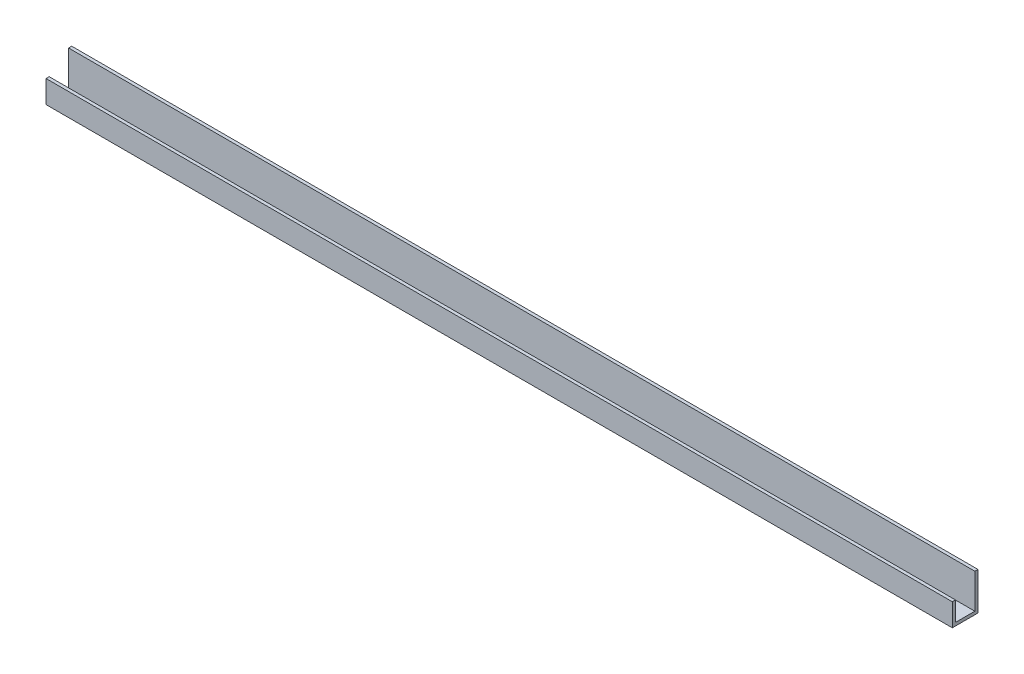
ISO-10303-21;
HEADER;
FILE_DESCRIPTION(('STEP AP214'),'2;1');
FILE_NAME('part.step','',(''),(''),'','','');
FILE_SCHEMA(('AUTOMOTIVE_DESIGN { 1 0 10303 214 1 1 1 1 }'));
ENDSEC;
DATA;
#1=APPLICATION_CONTEXT('core data for automotive mechanical design processes');
#2=APPLICATION_PROTOCOL_DEFINITION('international standard','automotive_design',2000,#1);
#3=PRODUCT_CONTEXT('',#1,'mechanical');
#4=PRODUCT('Part','Part','',(#3));
#5=PRODUCT_RELATED_PRODUCT_CATEGORY('part','',(#4));
#6=PRODUCT_DEFINITION_FORMATION('','',#4);
#7=PRODUCT_DEFINITION_CONTEXT('part definition',#1,'design');
#8=PRODUCT_DEFINITION('design','',#6,#7);
#9=PRODUCT_DEFINITION_SHAPE('','',#8);
#10=(LENGTH_UNIT() NAMED_UNIT(*) SI_UNIT(.MILLI.,.METRE.));
#11=(NAMED_UNIT(*) PLANE_ANGLE_UNIT() SI_UNIT($,.RADIAN.));
#12=(NAMED_UNIT(*) SI_UNIT($,.STERADIAN.) SOLID_ANGLE_UNIT());
#13=UNCERTAINTY_MEASURE_WITH_UNIT(LENGTH_MEASURE(1.E-05),#10,'distance_accuracy_value','');
#14=(GEOMETRIC_REPRESENTATION_CONTEXT(3) GLOBAL_UNCERTAINTY_ASSIGNED_CONTEXT((#13)) GLOBAL_UNIT_ASSIGNED_CONTEXT((#10,
#11,#12)) REPRESENTATION_CONTEXT('',''));
#15=CARTESIAN_POINT('',(0.,0.,0.));
#16=DIRECTION('',(0.,0.,1.));
#17=DIRECTION('',(1.,0.,0.));
#18=AXIS2_PLACEMENT_3D('',#15,#16,#17);
#19=CARTESIAN_POINT('',(0.,19.05,0.));
#20=DIRECTION('',(0.,1.,0.));
#21=DIRECTION('',(0.,0.,1.));
#22=AXIS2_PLACEMENT_3D('',#19,#20,#21);
#23=PLANE('',#22);
#24=DIRECTION('',(-1.,0.,0.));
#25=VECTOR('',#24,1.);
#26=CARTESIAN_POINT('',(0.,19.05,1.5875));
#27=LINE('',#26,#25);
#28=CARTESIAN_POINT('',(457.2,19.05,1.5875));
#29=VERTEX_POINT('',#28);
#30=CARTESIAN_POINT('',(0.,19.05,1.5875));
#31=VERTEX_POINT('',#30);
#32=EDGE_CURVE('E165',#29,#31,#27,.T.);
#33=ORIENTED_EDGE('',*,*,#32,.F.);
#34=DIRECTION('',(0.,0.,-1.));
#35=VECTOR('',#34,1.);
#36=CARTESIAN_POINT('',(457.2,19.05,0.));
#37=LINE('',#36,#35);
#38=CARTESIAN_POINT('',(457.2,19.05,0.));
#39=VERTEX_POINT('',#38);
#40=EDGE_CURVE('E177',#29,#39,#37,.T.);
#41=ORIENTED_EDGE('',*,*,#40,.T.);
#42=DIRECTION('',(-1.,0.,0.));
#43=VECTOR('',#42,1.);
#44=CARTESIAN_POINT('',(0.,19.05,0.));
#45=LINE('',#44,#43);
#46=CARTESIAN_POINT('',(0.,19.05,0.));
#47=VERTEX_POINT('',#46);
#48=EDGE_CURVE('E70',#39,#47,#45,.T.);
#49=ORIENTED_EDGE('',*,*,#48,.T.);
#50=DIRECTION('',(0.,0.,1.));
#51=VECTOR('',#50,1.);
#52=CARTESIAN_POINT('',(0.,19.05,0.));
#53=LINE('',#52,#51);
#54=EDGE_CURVE('E99',#47,#31,#53,.T.);
#55=ORIENTED_EDGE('',*,*,#54,.T.);
#56=EDGE_LOOP('',(#33,#41,#49,#55));
#57=FACE_BOUND('',#56,.T.);
#58=ADVANCED_FACE('F45',(#57),#23,.T.);
#59=CARTESIAN_POINT('',(0.,19.05,0.));
#60=DIRECTION('',(1.,0.,0.));
#61=DIRECTION('',(0.,0.,-1.));
#62=AXIS2_PLACEMENT_3D('',#59,#60,#61);
#63=PLANE('',#62);
#64=DIRECTION('',(0.,-1.,0.));
#65=VECTOR('',#64,1.);
#66=CARTESIAN_POINT('',(0.,19.05,12.954));
#67=LINE('',#66,#65);
#68=CARTESIAN_POINT('',(0.,11.4046,12.954));
#69=VERTEX_POINT('',#68);
#70=CARTESIAN_POINT('',(0.,0.,12.954));
#71=VERTEX_POINT('',#70);
#72=EDGE_CURVE('E11',#69,#71,#67,.T.);
#73=ORIENTED_EDGE('',*,*,#72,.F.);
#74=DIRECTION('',(0.,0.,1.));
#75=VECTOR('',#74,1.);
#76=CARTESIAN_POINT('',(0.,11.4046,-0.000999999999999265));
#77=LINE('',#76,#75);
#78=CARTESIAN_POINT('',(0.,11.4046,11.3665));
#79=VERTEX_POINT('',#78);
#80=EDGE_CURVE('E142',#79,#69,#77,.T.);
#81=ORIENTED_EDGE('',*,*,#80,.F.);
#82=DIRECTION('',(0.,1.,0.));
#83=VECTOR('',#82,1.);
#84=CARTESIAN_POINT('',(0.,1.5875,11.3665));
#85=LINE('',#84,#83);
#86=CARTESIAN_POINT('',(0.,1.5875,11.3665));
#87=VERTEX_POINT('',#86);
#88=EDGE_CURVE('E181',#87,#79,#85,.T.);
#89=ORIENTED_EDGE('',*,*,#88,.F.);
#90=DIRECTION('',(0.,0.,1.));
#91=VECTOR('',#90,1.);
#92=CARTESIAN_POINT('',(0.,1.5875,1.5875));
#93=LINE('',#92,#91);
#94=CARTESIAN_POINT('',(0.,1.5875,1.5875));
#95=VERTEX_POINT('',#94);
#96=EDGE_CURVE('E172',#95,#87,#93,.T.);
#97=ORIENTED_EDGE('',*,*,#96,.F.);
#98=DIRECTION('',(0.,1.,0.));
#99=VECTOR('',#98,1.);
#100=CARTESIAN_POINT('',(0.,1.5875,1.5875));
#101=LINE('',#100,#99);
#102=EDGE_CURVE('E114',#95,#31,#101,.T.);
#103=ORIENTED_EDGE('',*,*,#102,.T.);
#104=ORIENTED_EDGE('',*,*,#54,.F.);
#105=DIRECTION('',(0.,-1.,0.));
#106=VECTOR('',#105,1.);
#107=CARTESIAN_POINT('',(0.,19.05,0.));
#108=LINE('',#107,#106);
#109=CARTESIAN_POINT('',(0.,0.,0.));
#110=VERTEX_POINT('',#109);
#111=EDGE_CURVE('E91',#47,#110,#108,.T.);
#112=ORIENTED_EDGE('',*,*,#111,.T.);
#113=DIRECTION('',(0.,0.,1.));
#114=VECTOR('',#113,1.);
#115=CARTESIAN_POINT('',(0.,0.,0.));
#116=LINE('',#115,#114);
#117=EDGE_CURVE('E105',#110,#71,#116,.T.);
#118=ORIENTED_EDGE('',*,*,#117,.T.);
#119=EDGE_LOOP('',(#73,#81,#89,#97,#103,#104,#112,#118));
#120=FACE_BOUND('',#119,.T.);
#121=ADVANCED_FACE('F47',(#120),#63,.F.);
#122=CARTESIAN_POINT('',(0.,19.05,12.954));
#123=DIRECTION('',(0.,0.,-1.));
#124=DIRECTION('',(-1.,0.,0.));
#125=AXIS2_PLACEMENT_3D('',#122,#123,#124);
#126=PLANE('',#125);
#127=DIRECTION('',(0.,-1.,0.));
#128=VECTOR('',#127,1.);
#129=CARTESIAN_POINT('',(457.2,19.05,12.954));
#130=LINE('',#129,#128);
#131=CARTESIAN_POINT('',(457.2,11.4046,12.954));
#132=VERTEX_POINT('',#131);
#133=CARTESIAN_POINT('',(457.2,0.,12.954));
#134=VERTEX_POINT('',#133);
#135=EDGE_CURVE('E54',#132,#134,#130,.T.);
#136=ORIENTED_EDGE('',*,*,#135,.F.);
#137=DIRECTION('',(1.,0.,0.));
#138=VECTOR('',#137,1.);
#139=CARTESIAN_POINT('',(0.,11.4046,12.954));
#140=LINE('',#139,#138);
#141=EDGE_CURVE('E137',#69,#132,#140,.T.);
#142=ORIENTED_EDGE('',*,*,#141,.F.);
#143=ORIENTED_EDGE('',*,*,#72,.T.);
#144=DIRECTION('',(1.,0.,0.));
#145=VECTOR('',#144,1.);
#146=CARTESIAN_POINT('',(0.,0.,12.954));
#147=LINE('',#146,#145);
#148=EDGE_CURVE('E112',#71,#134,#147,.T.);
#149=ORIENTED_EDGE('',*,*,#148,.T.);
#150=EDGE_LOOP('',(#136,#142,#143,#149));
#151=FACE_BOUND('',#150,.T.);
#152=ADVANCED_FACE('F135',(#151),#126,.F.);
#153=CARTESIAN_POINT('',(457.2,19.05,0.));
#154=DIRECTION('',(-1.,0.,0.));
#155=DIRECTION('',(0.,0.,1.));
#156=AXIS2_PLACEMENT_3D('',#153,#154,#155);
#157=PLANE('',#156);
#158=DIRECTION('',(0.,1.,0.));
#159=VECTOR('',#158,1.);
#160=CARTESIAN_POINT('',(457.2,1.5875,11.3665));
#161=LINE('',#160,#159);
#162=CARTESIAN_POINT('',(457.2,1.5875,11.3665));
#163=VERTEX_POINT('',#162);
#164=CARTESIAN_POINT('',(457.2,11.4046,11.3665));
#165=VERTEX_POINT('',#164);
#166=EDGE_CURVE('E184',#163,#165,#161,.T.);
#167=ORIENTED_EDGE('',*,*,#166,.T.);
#168=DIRECTION('',(0.,0.,1.));
#169=VECTOR('',#168,1.);
#170=CARTESIAN_POINT('',(457.2,11.4046,-0.000999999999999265));
#171=LINE('',#170,#169);
#172=EDGE_CURVE('E61',#165,#132,#171,.T.);
#173=ORIENTED_EDGE('',*,*,#172,.T.);
#174=ORIENTED_EDGE('',*,*,#135,.T.);
#175=DIRECTION('',(0.,0.,-1.));
#176=VECTOR('',#175,1.);
#177=CARTESIAN_POINT('',(457.2,0.,0.));
#178=LINE('',#177,#176);
#179=CARTESIAN_POINT('',(457.2,0.,0.));
#180=VERTEX_POINT('',#179);
#181=EDGE_CURVE('E100',#134,#180,#178,.T.);
#182=ORIENTED_EDGE('',*,*,#181,.T.);
#183=DIRECTION('',(0.,-1.,0.));
#184=VECTOR('',#183,1.);
#185=CARTESIAN_POINT('',(457.2,19.05,0.));
#186=LINE('',#185,#184);
#187=EDGE_CURVE('E94',#39,#180,#186,.T.);
#188=ORIENTED_EDGE('',*,*,#187,.F.);
#189=ORIENTED_EDGE('',*,*,#40,.F.);
#190=DIRECTION('',(0.,1.,0.));
#191=VECTOR('',#190,1.);
#192=CARTESIAN_POINT('',(457.2,1.5875,1.5875));
#193=LINE('',#192,#191);
#194=CARTESIAN_POINT('',(457.2,1.5875,1.5875));
#195=VERTEX_POINT('',#194);
#196=EDGE_CURVE('E119',#195,#29,#193,.T.);
#197=ORIENTED_EDGE('',*,*,#196,.F.);
#198=DIRECTION('',(0.,0.,-1.));
#199=VECTOR('',#198,1.);
#200=CARTESIAN_POINT('',(457.2,1.5875,1.5875));
#201=LINE('',#200,#199);
#202=EDGE_CURVE('E192',#163,#195,#201,.T.);
#203=ORIENTED_EDGE('',*,*,#202,.F.);
#204=EDGE_LOOP('',(#167,#173,#174,#182,#188,#189,#197,#203));
#205=FACE_BOUND('',#204,.T.);
#206=ADVANCED_FACE('F131',(#205),#157,.F.);
#207=CARTESIAN_POINT('',(0.,19.05,0.));
#208=DIRECTION('',(0.,0.,1.));
#209=DIRECTION('',(1.,0.,0.));
#210=AXIS2_PLACEMENT_3D('',#207,#208,#209);
#211=PLANE('',#210);
#212=DIRECTION('',(-1.,0.,0.));
#213=VECTOR('',#212,1.);
#214=CARTESIAN_POINT('',(0.,0.,0.));
#215=LINE('',#214,#213);
#216=EDGE_CURVE('E88',#180,#110,#215,.T.);
#217=ORIENTED_EDGE('',*,*,#216,.T.);
#218=ORIENTED_EDGE('',*,*,#111,.F.);
#219=ORIENTED_EDGE('',*,*,#48,.F.);
#220=ORIENTED_EDGE('',*,*,#187,.T.);
#221=EDGE_LOOP('',(#217,#218,#219,#220));
#222=FACE_BOUND('',#221,.T.);
#223=ADVANCED_FACE('F90',(#222),#211,.F.);
#224=CARTESIAN_POINT('',(0.,0.,0.));
#225=DIRECTION('',(0.,1.,0.));
#226=DIRECTION('',(0.,0.,1.));
#227=AXIS2_PLACEMENT_3D('',#224,#225,#226);
#228=PLANE('',#227);
#229=ORIENTED_EDGE('',*,*,#117,.F.);
#230=ORIENTED_EDGE('',*,*,#216,.F.);
#231=ORIENTED_EDGE('',*,*,#181,.F.);
#232=ORIENTED_EDGE('',*,*,#148,.F.);
#233=EDGE_LOOP('',(#229,#230,#231,#232));
#234=FACE_BOUND('',#233,.T.);
#235=ADVANCED_FACE('F110',(#234),#228,.F.);
#236=CARTESIAN_POINT('',(0.,1.5875,1.5875));
#237=DIRECTION('',(0.,0.,-1.));
#238=DIRECTION('',(-1.,0.,0.));
#239=AXIS2_PLACEMENT_3D('',#236,#237,#238);
#240=PLANE('',#239);
#241=ORIENTED_EDGE('',*,*,#32,.T.);
#242=ORIENTED_EDGE('',*,*,#102,.F.);
#243=DIRECTION('',(-1.,0.,0.));
#244=VECTOR('',#243,1.);
#245=CARTESIAN_POINT('',(0.,1.5875,1.5875));
#246=LINE('',#245,#244);
#247=EDGE_CURVE('E185',#195,#95,#246,.T.);
#248=ORIENTED_EDGE('',*,*,#247,.F.);
#249=ORIENTED_EDGE('',*,*,#196,.T.);
#250=EDGE_LOOP('',(#241,#242,#248,#249));
#251=FACE_BOUND('',#250,.T.);
#252=ADVANCED_FACE('F166',(#251),#240,.F.);
#253=CARTESIAN_POINT('',(0.,1.5875,11.3665));
#254=DIRECTION('',(0.,0.,1.));
#255=DIRECTION('',(1.,0.,0.));
#256=AXIS2_PLACEMENT_3D('',#253,#254,#255);
#257=PLANE('',#256);
#258=ORIENTED_EDGE('',*,*,#88,.T.);
#259=DIRECTION('',(-1.,0.,0.));
#260=VECTOR('',#259,1.);
#261=CARTESIAN_POINT('',(0.,11.4046,11.3665));
#262=LINE('',#261,#260);
#263=EDGE_CURVE('E207',#165,#79,#262,.T.);
#264=ORIENTED_EDGE('',*,*,#263,.F.);
#265=ORIENTED_EDGE('',*,*,#166,.F.);
#266=DIRECTION('',(1.,0.,0.));
#267=VECTOR('',#266,1.);
#268=CARTESIAN_POINT('',(0.,1.5875,11.3665));
#269=LINE('',#268,#267);
#270=EDGE_CURVE('E195',#87,#163,#269,.T.);
#271=ORIENTED_EDGE('',*,*,#270,.F.);
#272=EDGE_LOOP('',(#258,#264,#265,#271));
#273=FACE_BOUND('',#272,.T.);
#274=ADVANCED_FACE('F211',(#273),#257,.F.);
#275=CARTESIAN_POINT('',(0.,1.5875,0.));
#276=DIRECTION('',(0.,1.,0.));
#277=DIRECTION('',(0.,0.,1.));
#278=AXIS2_PLACEMENT_3D('',#275,#276,#277);
#279=PLANE('',#278);
#280=ORIENTED_EDGE('',*,*,#96,.T.);
#281=ORIENTED_EDGE('',*,*,#270,.T.);
#282=ORIENTED_EDGE('',*,*,#202,.T.);
#283=ORIENTED_EDGE('',*,*,#247,.T.);
#284=EDGE_LOOP('',(#280,#281,#282,#283));
#285=FACE_BOUND('',#284,.T.);
#286=ADVANCED_FACE('F214',(#285),#279,.T.);
#287=CARTESIAN_POINT('',(0.,11.4046,-0.000999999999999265));
#288=DIRECTION('',(0.,-1.,0.));
#289=DIRECTION('',(0.,0.,-1.));
#290=AXIS2_PLACEMENT_3D('',#287,#288,#289);
#291=PLANE('',#290);
#292=ORIENTED_EDGE('',*,*,#263,.T.);
#293=ORIENTED_EDGE('',*,*,#80,.T.);
#294=ORIENTED_EDGE('',*,*,#141,.T.);
#295=ORIENTED_EDGE('',*,*,#172,.F.);
#296=EDGE_LOOP('',(#292,#293,#294,#295));
#297=FACE_BOUND('',#296,.T.);
#298=ADVANCED_FACE('F209',(#297),#291,.F.);
#299=CLOSED_SHELL('',(#58,#121,#152,#206,#223,#235,#252,#274,#286,#298));
#300=MANIFOLD_SOLID_BREP('B2',#299);
#301=ADVANCED_BREP_SHAPE_REPRESENTATION('',(#18,#300),#14);
#302=SHAPE_DEFINITION_REPRESENTATION(#9,#301);
ENDSEC;
END-ISO-10303-21;
